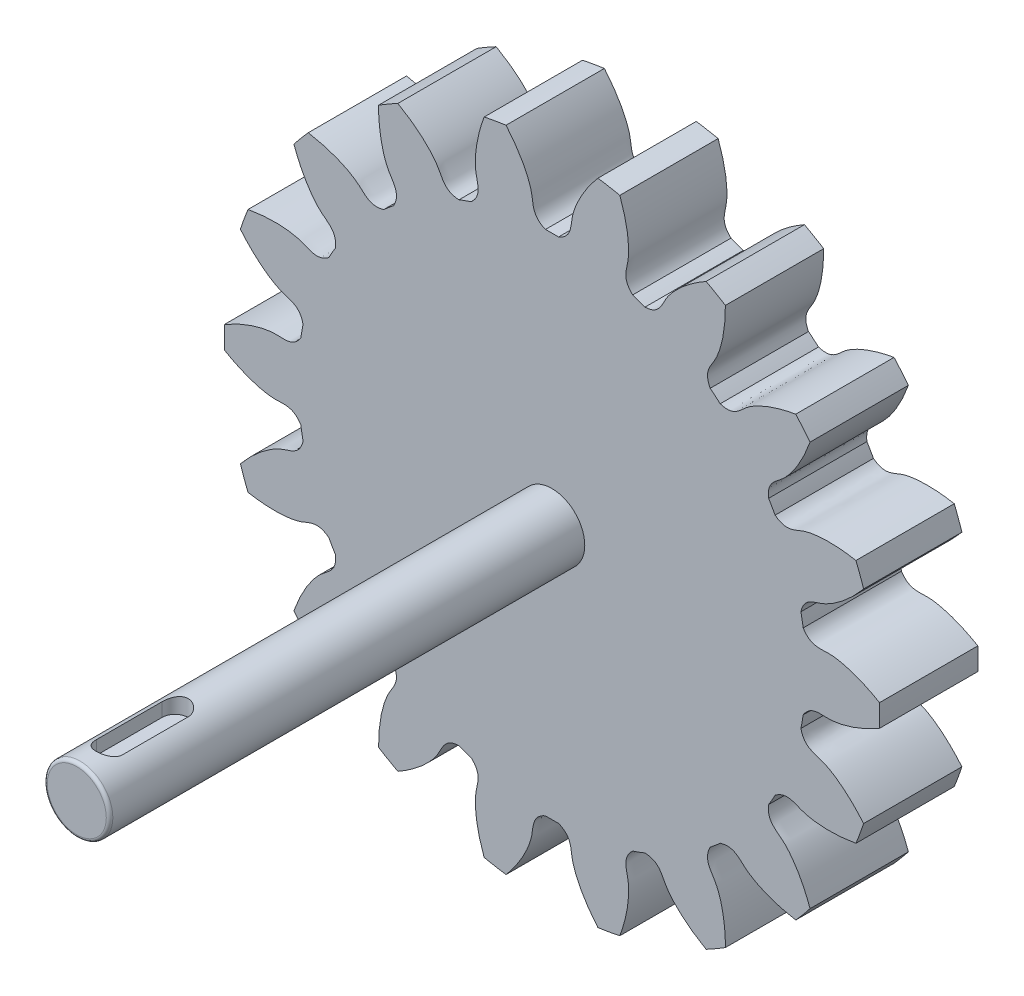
from build123d import *

# Parameters (mm, degrees)
SKETCH_1_R               = 20
EXTRUDE_1_DEPTH          = 6
CUT_EXTRUDE_1_DEPTH      = 29.91366459
PATTERN_CIRCULAR_1_COUNT = 18
SKETCH_4_R               = 2
EXTRUDE_2_DEPTH          = 29
FILLET_1_R               = 0.2
CUT_EXTRUDE_START        = 1
CUT_EXTRUDE_2_DEPTH      = 38


with BuildPart() as part:
    # Sketch 1 → Extrude 1 (new body)
    with BuildSketch(Plane.XY):
        Circle(SKETCH_1_R)
    extrude(amount=EXTRUDE_1_DEPTH)

    # Sketch 2 → Cut-Extrude 1 (cut, through all)
    with BuildSketch(Plane.XY):
        with BuildLine():
            ThreePointArc((0.398807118, 15.494868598), (0, 15.5), (-0.398807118, 15.494868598))
            add(Edge.make_bspline(
                [(-0.398807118, 15.494868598), (-1.23020808, 15.837360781), (-1.1255781, 16.477399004), (-1.263665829, 17.085190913), (-1.27750304, 17.141013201), (-1.294215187, 17.203080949), (-1.314049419, 17.271300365), (-1.337260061, 17.345568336), (-1.364095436, 17.425774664), (-1.394801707, 17.511801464), (-1.429621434, 17.603523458), (-1.46879375, 17.700807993), (-1.512554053, 17.803515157), (-1.561133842, 17.911497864), (-1.614760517, 18.02460196), (-1.673657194, 18.142666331), (-1.738042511, 18.265523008), (-1.80813045, 18.392997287), (-1.884130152, 18.524907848), (-1.96624574, 18.661066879), (-2.054676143, 18.801280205), (-2.149614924, 18.945347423), (-2.25125011, 19.09306204), (-2.359764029, 19.244211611), (-2.475333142, 19.398577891), (-2.598127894, 19.555936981), (-2.728312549, 19.716059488), (-2.866045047, 19.878710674), (-3.011476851, 20.043650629), (-3.164752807, 20.210634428), (-3.326011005, 20.379412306), (-3.495382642, 20.549729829), (-3.672991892, 20.72132807), (-3.858955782, 20.893943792), (-4.053384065, 21.067309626), (-4.256379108, 21.241154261), (-4.468035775, 21.415202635), (-4.68844132, 21.58917612), (-4.917675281, 21.762792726), (-5.155809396, 21.935767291), (-5.402907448, 22.107811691), (-5.748150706, 22.338079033), (-6.015110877, 22.504667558), (-6.197121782, 22.613356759)],
                knots=[0, 0, 0, 0, 0.187591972, 0.192996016, 0.1991206, 0.205965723, 0.213531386, 0.221817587, 0.230824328, 0.240551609, 0.250999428, 0.262167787, 0.274056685, 0.286666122, 0.299996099, 0.314046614, 0.32881767, 0.344309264, 0.360521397, 0.37745407, 0.395107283, 0.413481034, 0.432575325, 0.452390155, 0.472925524, 0.494181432, 0.51615788, 0.538854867, 0.562272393, 0.586410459, 0.611269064, 0.636848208, 0.663147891, 0.690168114, 0.717908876, 0.746370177, 0.775552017, 0.805454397, 0.836077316, 0.867420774, 0.899484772, 0.932269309, 1, 1, 1, 1], degree=3))
            ThreePointArc((-6.197121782, 22.613356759), (0, 23.447136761), (6.197121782, 22.613356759))
            add(Edge.make_bspline(
                [(0.398807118, 15.494868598), (1.23020808, 15.837360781), (1.1255781, 16.477399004), (1.263665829, 17.085190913), (1.27750304, 17.141013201), (1.294215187, 17.203080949), (1.314049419, 17.271300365), (1.337260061, 17.345568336), (1.364095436, 17.425774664), (1.394801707, 17.511801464), (1.429621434, 17.603523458), (1.46879375, 17.700807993), (1.512554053, 17.803515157), (1.561133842, 17.911497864), (1.614760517, 18.02460196), (1.673657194, 18.142666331), (1.738042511, 18.265523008), (1.80813045, 18.392997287), (1.884130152, 18.524907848), (1.96624574, 18.661066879), (2.054676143, 18.801280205), (2.149614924, 18.945347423), (2.25125011, 19.09306204), (2.359764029, 19.244211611), (2.475333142, 19.398577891), (2.598127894, 19.555936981), (2.728312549, 19.716059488), (2.866045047, 19.878710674), (3.011476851, 20.043650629), (3.164752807, 20.210634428), (3.326011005, 20.379412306), (3.495382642, 20.549729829), (3.672991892, 20.72132807), (3.858955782, 20.893943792), (4.053384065, 21.067309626), (4.256379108, 21.241154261), (4.468035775, 21.415202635), (4.68844132, 21.58917612), (4.917675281, 21.762792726), (5.155809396, 21.935767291), (5.402907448, 22.107811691), (5.748150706, 22.338079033), (6.015110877, 22.504667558), (6.197121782, 22.613356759)],
                knots=[0, 0, 0, 0, 0.187591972, 0.192996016, 0.1991206, 0.205965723, 0.213531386, 0.221817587, 0.230824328, 0.240551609, 0.250999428, 0.262167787, 0.274056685, 0.286666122, 0.299996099, 0.314046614, 0.32881767, 0.344309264, 0.360521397, 0.37745407, 0.395107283, 0.413481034, 0.432575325, 0.452390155, 0.472925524, 0.494181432, 0.51615788, 0.538854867, 0.562272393, 0.586410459, 0.611269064, 0.636848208, 0.663147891, 0.690168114, 0.717908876, 0.746370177, 0.775552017, 0.805454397, 0.836077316, 0.867420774, 0.899484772, 0.932269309, 1, 1, 1, 1], degree=3))
        make_face()
    cut_extrude_1 = extrude(amount=CUT_EXTRUDE_1_DEPTH, mode=Mode.SUBTRACT)

    # Pattern Circular 1: Cut-Extrude 1 ×18 about axis
    pattern_circular_1_axis = Axis((0, 0, 6), (0, 0, -1))
    for i in range(1, PATTERN_CIRCULAR_1_COUNT):
        add(cut_extrude_1.rotate(pattern_circular_1_axis, i * 360 / PATTERN_CIRCULAR_1_COUNT), mode=Mode.SUBTRACT)

    # Sketch 4 → Extrude 2 (add)
    with BuildSketch(Plane.XY.offset(6)):
        with Locations(Location((0, 0, 0), (0, 0, 180))):
            Circle(SKETCH_4_R)
    extrude(amount=EXTRUDE_2_DEPTH)

    # Fillet 1
    fillet_1_edges = [part.edges().sort_by_distance(p)[0] for p in [
        (2, 0, 35),
    ]]
    fillet(fillet_1_edges, radius=FILLET_1_R)

    # Sketch 5 → Cut-Extrude 2 (cut)
    with BuildSketch(Plane(origin=(0, 0, 0), x_dir=(1, 0, 0), z_dir=(0, 1, 0)).offset(CUT_EXTRUDE_START)):
        with BuildLine():
            Line((-0.8, -33), (-0.8, -29))
            ThreePointArc((-0.8, -29), (0, -28.2), (0.8, -29))
            Line((0.8, -29), (0.8, -33))
            ThreePointArc((0.8, -33), (0, -33.8), (-0.8, -33))
        make_face()
    extrude(amount=CUT_EXTRUDE_2_DEPTH, mode=Mode.SUBTRACT)


solid = part.part
